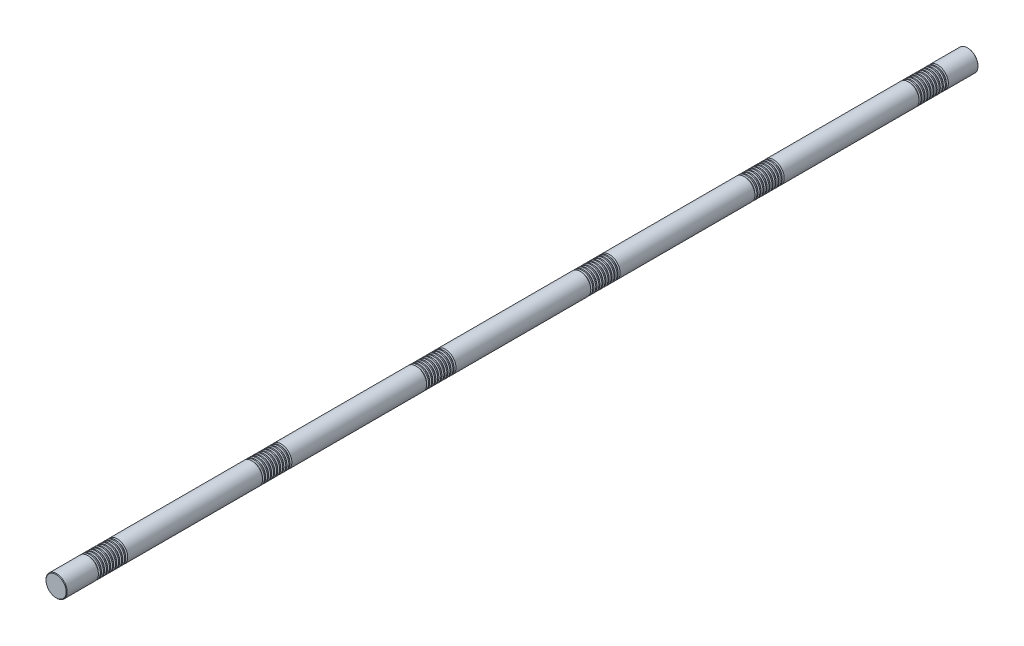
from build123d import *

# Parameters (mm, degrees)
SKETCH1_R           = 35
BOSS_EXTRUDE1_DEPTH = 1500
CHAMFER1_SIZE       = 1.75
LPATTERN1_COUNT     = 10
LPATTERN1_PITCH     = 10
LPATTERN2_COUNT     = 6
LPATTERN2_PITCH     = 540


with BuildPart() as part:
    # Sketch1 → Boss-Extrude1 (new, symmetric)
    with BuildSketch(Plane.XY):
        Circle(SKETCH1_R)
    extrude(amount=BOSS_EXTRUDE1_DEPTH, both=True)

    # Chamfer1
    chamfer1_edges = [part.edges().sort_by_distance(p)[0] for p in [
        (-35, 0, -1500),
        (-35, 0, 1500),
    ]]
    chamfer(chamfer1_edges, length=CHAMFER1_SIZE)

    # Sketch2 → Cut-Revolve1 (revolve, cut)
    with BuildSketch(Plane(origin=(0, 0, 0), x_dir=(0, 0, -1), z_dir=(1, 0, 0)), mode=Mode.PRIVATE) as cut_revolve1_sk:
        Polygon((1400.736860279, 35), (1394.263139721, 35), (1395.736860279, 29.5), (1399.263139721, 29.5), align=None)
    cut_revolve1 = revolve(cut_revolve1_sk.sketch.rotate(Axis((0, 0, 1500), (0, 0, -1)), 90), axis=Axis((0, 0, 1500), (0, 0, -1)), mode=Mode.SUBTRACT)

    # LPattern1: Cut-Revolve1 ×10
    with Locations(*[(0, 0, i * LPATTERN1_PITCH) for i in range(1, LPATTERN1_COUNT)]):
        add(cut_revolve1, mode=Mode.SUBTRACT)

    # LPattern2: Cut-Revolve1 ×6
    with Locations(*[(0, 0, i * LPATTERN2_PITCH) for i in range(1, LPATTERN2_COUNT)]):
        add(cut_revolve1, mode=Mode.SUBTRACT)

    # LPattern2 copy 1 sketch → LPattern2 copy 1 (revolve, cut)
    with BuildSketch(Plane(origin=(0, 0, 550), x_dir=(0, 0, -1), z_dir=(1, 0, 0))):
        Polygon((1400.736860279, 35), (1394.263139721, 35), (1395.736860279, 29.5), (1399.263139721, 29.5), align=None)
    revolve(axis=Axis((0, 0, 2050), (0, 0, -1)), mode=Mode.SUBTRACT)

    # LPattern2 copy 2 sketch → LPattern2 copy 2 (revolve, cut)
    with BuildSketch(Plane(origin=(0, 0, 1090), x_dir=(0, 0, -1), z_dir=(1, 0, 0))):
        Polygon((1400.736860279, 35), (1394.263139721, 35), (1395.736860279, 29.5), (1399.263139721, 29.5), align=None)
    revolve(axis=Axis((0, 0, 2590), (0, 0, -1)), mode=Mode.SUBTRACT)

    # LPattern2 copy 3 sketch → LPattern2 copy 3 (revolve, cut)
    with BuildSketch(Plane(origin=(0, 0, 1630), x_dir=(0, 0, -1), z_dir=(1, 0, 0))):
        Polygon((1400.736860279, 35), (1394.263139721, 35), (1395.736860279, 29.5), (1399.263139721, 29.5), align=None)
    revolve(axis=Axis((0, 0, 3130), (0, 0, -1)), mode=Mode.SUBTRACT)

    # LPattern2 copy 4 sketch → LPattern2 copy 4 (revolve, cut)
    with BuildSketch(Plane(origin=(0, 0, 2170), x_dir=(0, 0, -1), z_dir=(1, 0, 0))):
        Polygon((1400.736860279, 35), (1394.263139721, 35), (1395.736860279, 29.5), (1399.263139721, 29.5), align=None)
    revolve(axis=Axis((0, 0, 3670), (0, 0, -1)), mode=Mode.SUBTRACT)

    # LPattern2 copy 5 sketch → LPattern2 copy 5 (revolve, cut)
    with BuildSketch(Plane(origin=(0, 0, 2710), x_dir=(0, 0, -1), z_dir=(1, 0, 0))):
        Polygon((1400.736860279, 35), (1394.263139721, 35), (1395.736860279, 29.5), (1399.263139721, 29.5), align=None)
    revolve(axis=Axis((0, 0, 4210), (0, 0, -1)), mode=Mode.SUBTRACT)

    # LPattern2 copy 6 sketch → LPattern2 copy 6 (revolve, cut)
    with BuildSketch(Plane(origin=(0, 0, 560), x_dir=(0, 0, -1), z_dir=(1, 0, 0))):
        Polygon((1400.736860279, 35), (1394.263139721, 35), (1395.736860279, 29.5), (1399.263139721, 29.5), align=None)
    revolve(axis=Axis((0, 0, 2060), (0, 0, -1)), mode=Mode.SUBTRACT)

    # LPattern2 copy 7 sketch → LPattern2 copy 7 (revolve, cut)
    with BuildSketch(Plane(origin=(0, 0, 1100), x_dir=(0, 0, -1), z_dir=(1, 0, 0))):
        Polygon((1400.736860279, 35), (1394.263139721, 35), (1395.736860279, 29.5), (1399.263139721, 29.5), align=None)
    revolve(axis=Axis((0, 0, 2600), (0, 0, -1)), mode=Mode.SUBTRACT)

    # LPattern2 copy 8 sketch → LPattern2 copy 8 (revolve, cut)
    with BuildSketch(Plane(origin=(0, 0, 1640), x_dir=(0, 0, -1), z_dir=(1, 0, 0))):
        Polygon((1400.736860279, 35), (1394.263139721, 35), (1395.736860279, 29.5), (1399.263139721, 29.5), align=None)
    revolve(axis=Axis((0, 0, 3140), (0, 0, -1)), mode=Mode.SUBTRACT)

    # LPattern2 copy 9 sketch → LPattern2 copy 9 (revolve, cut)
    with BuildSketch(Plane(origin=(0, 0, 2180), x_dir=(0, 0, -1), z_dir=(1, 0, 0))):
        Polygon((1400.736860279, 35), (1394.263139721, 35), (1395.736860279, 29.5), (1399.263139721, 29.5), align=None)
    revolve(axis=Axis((0, 0, 3680), (0, 0, -1)), mode=Mode.SUBTRACT)

    # LPattern2 copy 10 sketch → LPattern2 copy 10 (revolve, cut)
    with BuildSketch(Plane(origin=(0, 0, 2720), x_dir=(0, 0, -1), z_dir=(1, 0, 0))):
        Polygon((1400.736860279, 35), (1394.263139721, 35), (1395.736860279, 29.5), (1399.263139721, 29.5), align=None)
    revolve(axis=Axis((0, 0, 4220), (0, 0, -1)), mode=Mode.SUBTRACT)

    # LPattern2 copy 11 sketch → LPattern2 copy 11 (revolve, cut)
    with BuildSketch(Plane(origin=(0, 0, 570), x_dir=(0, 0, -1), z_dir=(1, 0, 0))):
        Polygon((1400.736860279, 35), (1394.263139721, 35), (1395.736860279, 29.5), (1399.263139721, 29.5), align=None)
    revolve(axis=Axis((0, 0, 2070), (0, 0, -1)), mode=Mode.SUBTRACT)

    # LPattern2 copy 12 sketch → LPattern2 copy 12 (revolve, cut)
    with BuildSketch(Plane(origin=(0, 0, 1110), x_dir=(0, 0, -1), z_dir=(1, 0, 0))):
        Polygon((1400.736860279, 35), (1394.263139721, 35), (1395.736860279, 29.5), (1399.263139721, 29.5), align=None)
    revolve(axis=Axis((0, 0, 2610), (0, 0, -1)), mode=Mode.SUBTRACT)

    # LPattern2 copy 13 sketch → LPattern2 copy 13 (revolve, cut)
    with BuildSketch(Plane(origin=(0, 0, 1650), x_dir=(0, 0, -1), z_dir=(1, 0, 0))):
        Polygon((1400.736860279, 35), (1394.263139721, 35), (1395.736860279, 29.5), (1399.263139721, 29.5), align=None)
    revolve(axis=Axis((0, 0, 3150), (0, 0, -1)), mode=Mode.SUBTRACT)

    # LPattern2 copy 14 sketch → LPattern2 copy 14 (revolve, cut)
    with BuildSketch(Plane(origin=(0, 0, 2190), x_dir=(0, 0, -1), z_dir=(1, 0, 0))):
        Polygon((1400.736860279, 35), (1394.263139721, 35), (1395.736860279, 29.5), (1399.263139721, 29.5), align=None)
    revolve(axis=Axis((0, 0, 3690), (0, 0, -1)), mode=Mode.SUBTRACT)

    # LPattern2 copy 15 sketch → LPattern2 copy 15 (revolve, cut)
    with BuildSketch(Plane(origin=(0, 0, 2730), x_dir=(0, 0, -1), z_dir=(1, 0, 0))):
        Polygon((1400.736860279, 35), (1394.263139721, 35), (1395.736860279, 29.5), (1399.263139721, 29.5), align=None)
    revolve(axis=Axis((0, 0, 4230), (0, 0, -1)), mode=Mode.SUBTRACT)

    # LPattern2 copy 16 sketch → LPattern2 copy 16 (revolve, cut)
    with BuildSketch(Plane(origin=(0, 0, 580), x_dir=(0, 0, -1), z_dir=(1, 0, 0))):
        Polygon((1400.736860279, 35), (1394.263139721, 35), (1395.736860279, 29.5), (1399.263139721, 29.5), align=None)
    revolve(axis=Axis((0, 0, 2080), (0, 0, -1)), mode=Mode.SUBTRACT)

    # LPattern2 copy 17 sketch → LPattern2 copy 17 (revolve, cut)
    with BuildSketch(Plane(origin=(0, 0, 1120), x_dir=(0, 0, -1), z_dir=(1, 0, 0))):
        Polygon((1400.736860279, 35), (1394.263139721, 35), (1395.736860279, 29.5), (1399.263139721, 29.5), align=None)
    revolve(axis=Axis((0, 0, 2620), (0, 0, -1)), mode=Mode.SUBTRACT)

    # LPattern2 copy 18 sketch → LPattern2 copy 18 (revolve, cut)
    with BuildSketch(Plane(origin=(0, 0, 1660), x_dir=(0, 0, -1), z_dir=(1, 0, 0))):
        Polygon((1400.736860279, 35), (1394.263139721, 35), (1395.736860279, 29.5), (1399.263139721, 29.5), align=None)
    revolve(axis=Axis((0, 0, 3160), (0, 0, -1)), mode=Mode.SUBTRACT)

    # LPattern2 copy 19 sketch → LPattern2 copy 19 (revolve, cut)
    with BuildSketch(Plane(origin=(0, 0, 2200), x_dir=(0, 0, -1), z_dir=(1, 0, 0))):
        Polygon((1400.736860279, 35), (1394.263139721, 35), (1395.736860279, 29.5), (1399.263139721, 29.5), align=None)
    revolve(axis=Axis((0, 0, 3700), (0, 0, -1)), mode=Mode.SUBTRACT)

    # LPattern2 copy 20 sketch → LPattern2 copy 20 (revolve, cut)
    with BuildSketch(Plane(origin=(0, 0, 2740), x_dir=(0, 0, -1), z_dir=(1, 0, 0))):
        Polygon((1400.736860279, 35), (1394.263139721, 35), (1395.736860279, 29.5), (1399.263139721, 29.5), align=None)
    revolve(axis=Axis((0, 0, 4240), (0, 0, -1)), mode=Mode.SUBTRACT)

    # LPattern2 copy 21 sketch → LPattern2 copy 21 (revolve, cut)
    with BuildSketch(Plane(origin=(0, 0, 590), x_dir=(0, 0, -1), z_dir=(1, 0, 0))):
        Polygon((1400.736860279, 35), (1394.263139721, 35), (1395.736860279, 29.5), (1399.263139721, 29.5), align=None)
    revolve(axis=Axis((0, 0, 2090), (0, 0, -1)), mode=Mode.SUBTRACT)

    # LPattern2 copy 22 sketch → LPattern2 copy 22 (revolve, cut)
    with BuildSketch(Plane(origin=(0, 0, 1130), x_dir=(0, 0, -1), z_dir=(1, 0, 0))):
        Polygon((1400.736860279, 35), (1394.263139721, 35), (1395.736860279, 29.5), (1399.263139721, 29.5), align=None)
    revolve(axis=Axis((0, 0, 2630), (0, 0, -1)), mode=Mode.SUBTRACT)

    # LPattern2 copy 23 sketch → LPattern2 copy 23 (revolve, cut)
    with BuildSketch(Plane(origin=(0, 0, 1670), x_dir=(0, 0, -1), z_dir=(1, 0, 0))):
        Polygon((1400.736860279, 35), (1394.263139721, 35), (1395.736860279, 29.5), (1399.263139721, 29.5), align=None)
    revolve(axis=Axis((0, 0, 3170), (0, 0, -1)), mode=Mode.SUBTRACT)

    # LPattern2 copy 24 sketch → LPattern2 copy 24 (revolve, cut)
    with BuildSketch(Plane(origin=(0, 0, 2210), x_dir=(0, 0, -1), z_dir=(1, 0, 0))):
        Polygon((1400.736860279, 35), (1394.263139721, 35), (1395.736860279, 29.5), (1399.263139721, 29.5), align=None)
    revolve(axis=Axis((0, 0, 3710), (0, 0, -1)), mode=Mode.SUBTRACT)

    # LPattern2 copy 25 sketch → LPattern2 copy 25 (revolve, cut)
    with BuildSketch(Plane(origin=(0, 0, 2750), x_dir=(0, 0, -1), z_dir=(1, 0, 0))):
        Polygon((1400.736860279, 35), (1394.263139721, 35), (1395.736860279, 29.5), (1399.263139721, 29.5), align=None)
    revolve(axis=Axis((0, 0, 4250), (0, 0, -1)), mode=Mode.SUBTRACT)

    # LPattern2 copy 26 sketch → LPattern2 copy 26 (revolve, cut)
    with BuildSketch(Plane(origin=(0, 0, 600), x_dir=(0, 0, -1), z_dir=(1, 0, 0))):
        Polygon((1400.736860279, 35), (1394.263139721, 35), (1395.736860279, 29.5), (1399.263139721, 29.5), align=None)
    revolve(axis=Axis((0, 0, 2100), (0, 0, -1)), mode=Mode.SUBTRACT)

    # LPattern2 copy 27 sketch → LPattern2 copy 27 (revolve, cut)
    with BuildSketch(Plane(origin=(0, 0, 1140), x_dir=(0, 0, -1), z_dir=(1, 0, 0))):
        Polygon((1400.736860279, 35), (1394.263139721, 35), (1395.736860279, 29.5), (1399.263139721, 29.5), align=None)
    revolve(axis=Axis((0, 0, 2640), (0, 0, -1)), mode=Mode.SUBTRACT)

    # LPattern2 copy 28 sketch → LPattern2 copy 28 (revolve, cut)
    with BuildSketch(Plane(origin=(0, 0, 1680), x_dir=(0, 0, -1), z_dir=(1, 0, 0))):
        Polygon((1400.736860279, 35), (1394.263139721, 35), (1395.736860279, 29.5), (1399.263139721, 29.5), align=None)
    revolve(axis=Axis((0, 0, 3180), (0, 0, -1)), mode=Mode.SUBTRACT)

    # LPattern2 copy 29 sketch → LPattern2 copy 29 (revolve, cut)
    with BuildSketch(Plane(origin=(0, 0, 2220), x_dir=(0, 0, -1), z_dir=(1, 0, 0))):
        Polygon((1400.736860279, 35), (1394.263139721, 35), (1395.736860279, 29.5), (1399.263139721, 29.5), align=None)
    revolve(axis=Axis((0, 0, 3720), (0, 0, -1)), mode=Mode.SUBTRACT)

    # LPattern2 copy 30 sketch → LPattern2 copy 30 (revolve, cut)
    with BuildSketch(Plane(origin=(0, 0, 2760), x_dir=(0, 0, -1), z_dir=(1, 0, 0))):
        Polygon((1400.736860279, 35), (1394.263139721, 35), (1395.736860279, 29.5), (1399.263139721, 29.5), align=None)
    revolve(axis=Axis((0, 0, 4260), (0, 0, -1)), mode=Mode.SUBTRACT)

    # LPattern2 copy 31 sketch → LPattern2 copy 31 (revolve, cut)
    with BuildSketch(Plane(origin=(0, 0, 610), x_dir=(0, 0, -1), z_dir=(1, 0, 0))):
        Polygon((1400.736860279, 35), (1394.263139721, 35), (1395.736860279, 29.5), (1399.263139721, 29.5), align=None)
    revolve(axis=Axis((0, 0, 2110), (0, 0, -1)), mode=Mode.SUBTRACT)

    # LPattern2 copy 32 sketch → LPattern2 copy 32 (revolve, cut)
    with BuildSketch(Plane(origin=(0, 0, 1150), x_dir=(0, 0, -1), z_dir=(1, 0, 0))):
        Polygon((1400.736860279, 35), (1394.263139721, 35), (1395.736860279, 29.5), (1399.263139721, 29.5), align=None)
    revolve(axis=Axis((0, 0, 2650), (0, 0, -1)), mode=Mode.SUBTRACT)

    # LPattern2 copy 33 sketch → LPattern2 copy 33 (revolve, cut)
    with BuildSketch(Plane(origin=(0, 0, 1690), x_dir=(0, 0, -1), z_dir=(1, 0, 0))):
        Polygon((1400.736860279, 35), (1394.263139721, 35), (1395.736860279, 29.5), (1399.263139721, 29.5), align=None)
    revolve(axis=Axis((0, 0, 3190), (0, 0, -1)), mode=Mode.SUBTRACT)

    # LPattern2 copy 34 sketch → LPattern2 copy 34 (revolve, cut)
    with BuildSketch(Plane(origin=(0, 0, 2230), x_dir=(0, 0, -1), z_dir=(1, 0, 0))):
        Polygon((1400.736860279, 35), (1394.263139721, 35), (1395.736860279, 29.5), (1399.263139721, 29.5), align=None)
    revolve(axis=Axis((0, 0, 3730), (0, 0, -1)), mode=Mode.SUBTRACT)

    # LPattern2 copy 35 sketch → LPattern2 copy 35 (revolve, cut)
    with BuildSketch(Plane(origin=(0, 0, 2770), x_dir=(0, 0, -1), z_dir=(1, 0, 0))):
        Polygon((1400.736860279, 35), (1394.263139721, 35), (1395.736860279, 29.5), (1399.263139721, 29.5), align=None)
    revolve(axis=Axis((0, 0, 4270), (0, 0, -1)), mode=Mode.SUBTRACT)

    # LPattern2 copy 36 sketch → LPattern2 copy 36 (revolve, cut)
    with BuildSketch(Plane(origin=(0, 0, 620), x_dir=(0, 0, -1), z_dir=(1, 0, 0))):
        Polygon((1400.736860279, 35), (1394.263139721, 35), (1395.736860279, 29.5), (1399.263139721, 29.5), align=None)
    revolve(axis=Axis((0, 0, 2120), (0, 0, -1)), mode=Mode.SUBTRACT)

    # LPattern2 copy 37 sketch → LPattern2 copy 37 (revolve, cut)
    with BuildSketch(Plane(origin=(0, 0, 1160), x_dir=(0, 0, -1), z_dir=(1, 0, 0))):
        Polygon((1400.736860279, 35), (1394.263139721, 35), (1395.736860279, 29.5), (1399.263139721, 29.5), align=None)
    revolve(axis=Axis((0, 0, 2660), (0, 0, -1)), mode=Mode.SUBTRACT)

    # LPattern2 copy 38 sketch → LPattern2 copy 38 (revolve, cut)
    with BuildSketch(Plane(origin=(0, 0, 1700), x_dir=(0, 0, -1), z_dir=(1, 0, 0))):
        Polygon((1400.736860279, 35), (1394.263139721, 35), (1395.736860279, 29.5), (1399.263139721, 29.5), align=None)
    revolve(axis=Axis((0, 0, 3200), (0, 0, -1)), mode=Mode.SUBTRACT)

    # LPattern2 copy 39 sketch → LPattern2 copy 39 (revolve, cut)
    with BuildSketch(Plane(origin=(0, 0, 2240), x_dir=(0, 0, -1), z_dir=(1, 0, 0))):
        Polygon((1400.736860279, 35), (1394.263139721, 35), (1395.736860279, 29.5), (1399.263139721, 29.5), align=None)
    revolve(axis=Axis((0, 0, 3740), (0, 0, -1)), mode=Mode.SUBTRACT)

    # LPattern2 copy 40 sketch → LPattern2 copy 40 (revolve, cut)
    with BuildSketch(Plane(origin=(0, 0, 2780), x_dir=(0, 0, -1), z_dir=(1, 0, 0))):
        Polygon((1400.736860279, 35), (1394.263139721, 35), (1395.736860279, 29.5), (1399.263139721, 29.5), align=None)
    revolve(axis=Axis((0, 0, 4280), (0, 0, -1)), mode=Mode.SUBTRACT)

    # LPattern2 copy 41 sketch → LPattern2 copy 41 (revolve, cut)
    with BuildSketch(Plane(origin=(0, 0, 630), x_dir=(0, 0, -1), z_dir=(1, 0, 0))):
        Polygon((1400.736860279, 35), (1394.263139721, 35), (1395.736860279, 29.5), (1399.263139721, 29.5), align=None)
    revolve(axis=Axis((0, 0, 2130), (0, 0, -1)), mode=Mode.SUBTRACT)

    # LPattern2 copy 42 sketch → LPattern2 copy 42 (revolve, cut)
    with BuildSketch(Plane(origin=(0, 0, 1170), x_dir=(0, 0, -1), z_dir=(1, 0, 0))):
        Polygon((1400.736860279, 35), (1394.263139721, 35), (1395.736860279, 29.5), (1399.263139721, 29.5), align=None)
    revolve(axis=Axis((0, 0, 2670), (0, 0, -1)), mode=Mode.SUBTRACT)

    # LPattern2 copy 43 sketch → LPattern2 copy 43 (revolve, cut)
    with BuildSketch(Plane(origin=(0, 0, 1710), x_dir=(0, 0, -1), z_dir=(1, 0, 0))):
        Polygon((1400.736860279, 35), (1394.263139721, 35), (1395.736860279, 29.5), (1399.263139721, 29.5), align=None)
    revolve(axis=Axis((0, 0, 3210), (0, 0, -1)), mode=Mode.SUBTRACT)

    # LPattern2 copy 44 sketch → LPattern2 copy 44 (revolve, cut)
    with BuildSketch(Plane(origin=(0, 0, 2250), x_dir=(0, 0, -1), z_dir=(1, 0, 0))):
        Polygon((1400.736860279, 35), (1394.263139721, 35), (1395.736860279, 29.5), (1399.263139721, 29.5), align=None)
    revolve(axis=Axis((0, 0, 3750), (0, 0, -1)), mode=Mode.SUBTRACT)

    # LPattern2 copy 45 sketch → LPattern2 copy 45 (revolve, cut)
    with BuildSketch(Plane(origin=(0, 0, 2790), x_dir=(0, 0, -1), z_dir=(1, 0, 0))):
        Polygon((1400.736860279, 35), (1394.263139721, 35), (1395.736860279, 29.5), (1399.263139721, 29.5), align=None)
    revolve(axis=Axis((0, 0, 4290), (0, 0, -1)), mode=Mode.SUBTRACT)


solid = part.part
